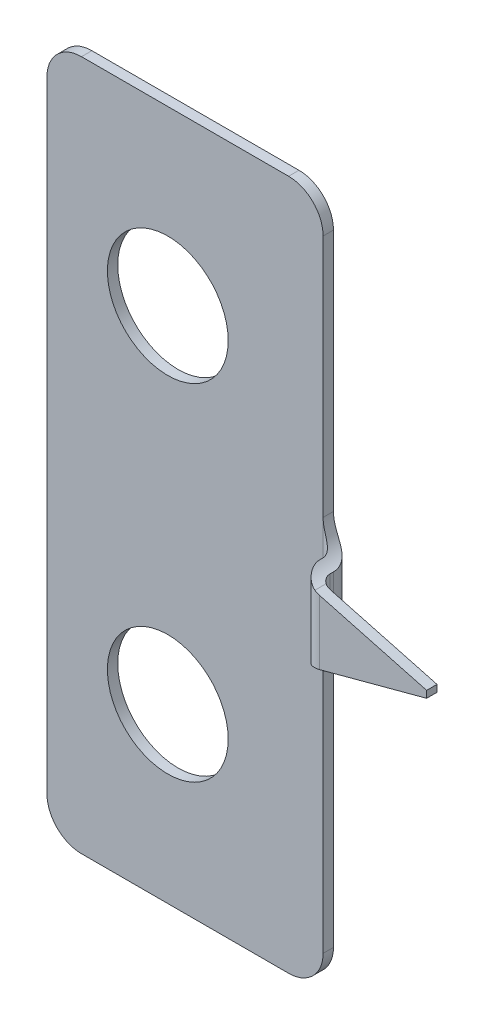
ISO-10303-21;
HEADER;
FILE_DESCRIPTION(('STEP AP214'),'2;1');
FILE_NAME('part.step','',(''),(''),'','','');
FILE_SCHEMA(('AUTOMOTIVE_DESIGN { 1 0 10303 214 1 1 1 1 }'));
ENDSEC;
DATA;
#1=APPLICATION_CONTEXT('core data for automotive mechanical design processes');
#2=APPLICATION_PROTOCOL_DEFINITION('international standard','automotive_design',2000,#1);
#3=PRODUCT_CONTEXT('',#1,'mechanical');
#4=PRODUCT('Part','Part','',(#3));
#5=PRODUCT_RELATED_PRODUCT_CATEGORY('part','',(#4));
#6=PRODUCT_DEFINITION_FORMATION('','',#4);
#7=PRODUCT_DEFINITION_CONTEXT('part definition',#1,'design');
#8=PRODUCT_DEFINITION('design','',#6,#7);
#9=PRODUCT_DEFINITION_SHAPE('','',#8);
#10=(LENGTH_UNIT() NAMED_UNIT(*) SI_UNIT(.MILLI.,.METRE.));
#11=(NAMED_UNIT(*) PLANE_ANGLE_UNIT() SI_UNIT($,.RADIAN.));
#12=(NAMED_UNIT(*) SI_UNIT($,.STERADIAN.) SOLID_ANGLE_UNIT());
#13=UNCERTAINTY_MEASURE_WITH_UNIT(LENGTH_MEASURE(1.E-05),#10,'distance_accuracy_value','');
#14=(GEOMETRIC_REPRESENTATION_CONTEXT(3) GLOBAL_UNCERTAINTY_ASSIGNED_CONTEXT((#13)) GLOBAL_UNIT_ASSIGNED_CONTEXT((#10,
#11,#12)) REPRESENTATION_CONTEXT('',''));
#15=CARTESIAN_POINT('',(0.,0.,0.));
#16=DIRECTION('',(0.,0.,1.));
#17=DIRECTION('',(1.,0.,0.));
#18=AXIS2_PLACEMENT_3D('',#15,#16,#17);
#19=CARTESIAN_POINT('',(-2.5,4.,0.));
#20=DIRECTION('',(0.,0.,-1.));
#21=DIRECTION('',(-1.,0.,0.));
#22=AXIS2_PLACEMENT_3D('',#19,#20,#21);
#23=PLANE('',#22);
#24=CARTESIAN_POINT('',(0.,-10.,0.));
#25=DIRECTION('',(0.,0.,-1.));
#26=DIRECTION('',(-1.,0.,0.));
#27=AXIS2_PLACEMENT_3D('',#24,#25,#26);
#28=CIRCLE('',#27,1.75);
#29=CARTESIAN_POINT('',(-1.75,-10.,0.));
#30=VERTEX_POINT('',#29);
#31=EDGE_CURVE('E436',#30,#30,#28,.T.);
#32=ORIENTED_EDGE('',*,*,#31,.F.);
#33=EDGE_LOOP('',(#32));
#34=FACE_BOUND('',#33,.T.);
#35=CARTESIAN_POINT('',(0.,0.,0.));
#36=DIRECTION('',(0.,0.,-1.));
#37=DIRECTION('',(-1.,0.,0.));
#38=AXIS2_PLACEMENT_3D('',#35,#36,#37);
#39=CIRCLE('',#38,1.75);
#40=CARTESIAN_POINT('',(-1.75,0.,0.));
#41=VERTEX_POINT('',#40);
#42=EDGE_CURVE('E424',#41,#41,#39,.T.);
#43=ORIENTED_EDGE('',*,*,#42,.F.);
#44=EDGE_LOOP('',(#43));
#45=FACE_BOUND('',#44,.T.);
#46=DIRECTION('',(0.,1.,0.));
#47=VECTOR('',#46,1.);
#48=CARTESIAN_POINT('',(4.5,4.,0.));
#49=LINE('',#48,#47);
#50=CARTESIAN_POINT('',(4.5,-3.06087624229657,0.));
#51=VERTEX_POINT('',#50);
#52=CARTESIAN_POINT('',(4.5,4.,0.));
#53=VERTEX_POINT('',#52);
#54=EDGE_CURVE('E122',#51,#53,#49,.T.);
#55=ORIENTED_EDGE('',*,*,#54,.F.);
#56=DIRECTION('',(0.,1.,0.));
#57=VECTOR('',#56,1.);
#58=CARTESIAN_POINT('',(4.5,-15.,0.));
#59=LINE('',#58,#57);
#60=CARTESIAN_POINT('',(4.5,-6.93912375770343,0.));
#61=VERTEX_POINT('',#60);
#62=EDGE_CURVE('E162',#51,#61,#59,.F.);
#63=ORIENTED_EDGE('',*,*,#62,.T.);
#64=DIRECTION('',(0.,1.,0.));
#65=VECTOR('',#64,1.);
#66=CARTESIAN_POINT('',(4.5,-14.,0.));
#67=LINE('',#66,#65);
#68=CARTESIAN_POINT('',(4.5,-14.,0.));
#69=VERTEX_POINT('',#68);
#70=EDGE_CURVE('E119',#69,#61,#67,.T.);
#71=ORIENTED_EDGE('',*,*,#70,.F.);
#72=CARTESIAN_POINT('',(3.5,-14.,0.));
#73=DIRECTION('',(0.,0.,1.));
#74=DIRECTION('',(1.,0.,0.));
#75=AXIS2_PLACEMENT_3D('',#72,#73,#74);
#76=CIRCLE('',#75,1.);
#77=CARTESIAN_POINT('',(3.5,-15.,0.));
#78=VERTEX_POINT('',#77);
#79=EDGE_CURVE('E116',#78,#69,#76,.T.);
#80=ORIENTED_EDGE('',*,*,#79,.F.);
#81=DIRECTION('',(1.,0.,0.));
#82=VECTOR('',#81,1.);
#83=CARTESIAN_POINT('',(-2.5,-15.,0.));
#84=LINE('',#83,#82);
#85=CARTESIAN_POINT('',(-2.5,-15.,0.));
#86=VERTEX_POINT('',#85);
#87=EDGE_CURVE('E113',#86,#78,#84,.T.);
#88=ORIENTED_EDGE('',*,*,#87,.F.);
#89=CARTESIAN_POINT('',(-2.5,-14.,0.));
#90=DIRECTION('',(0.,0.,1.));
#91=DIRECTION('',(1.,0.,0.));
#92=AXIS2_PLACEMENT_3D('',#89,#90,#91);
#93=CIRCLE('',#92,1.);
#94=CARTESIAN_POINT('',(-3.5,-14.,0.));
#95=VERTEX_POINT('',#94);
#96=EDGE_CURVE('E103',#95,#86,#93,.T.);
#97=ORIENTED_EDGE('',*,*,#96,.F.);
#98=DIRECTION('',(0.,-1.,0.));
#99=VECTOR('',#98,1.);
#100=CARTESIAN_POINT('',(-3.5,4.,0.));
#101=LINE('',#100,#99);
#102=CARTESIAN_POINT('',(-3.5,4.,0.));
#103=VERTEX_POINT('',#102);
#104=EDGE_CURVE('E100',#103,#95,#101,.T.);
#105=ORIENTED_EDGE('',*,*,#104,.F.);
#106=CARTESIAN_POINT('',(-2.5,4.,0.));
#107=DIRECTION('',(0.,0.,1.));
#108=DIRECTION('',(-1.,0.,0.));
#109=AXIS2_PLACEMENT_3D('',#106,#107,#108);
#110=CIRCLE('',#109,1.);
#111=CARTESIAN_POINT('',(-2.5,5.,0.));
#112=VERTEX_POINT('',#111);
#113=EDGE_CURVE('E77',#112,#103,#110,.T.);
#114=ORIENTED_EDGE('',*,*,#113,.F.);
#115=DIRECTION('',(-1.,0.,0.));
#116=VECTOR('',#115,1.);
#117=CARTESIAN_POINT('',(-2.5,5.,0.));
#118=LINE('',#117,#116);
#119=CARTESIAN_POINT('',(3.5,5.,0.));
#120=VERTEX_POINT('',#119);
#121=EDGE_CURVE('E87',#120,#112,#118,.T.);
#122=ORIENTED_EDGE('',*,*,#121,.F.);
#123=CARTESIAN_POINT('',(3.5,4.,0.));
#124=DIRECTION('',(0.,0.,1.));
#125=DIRECTION('',(-1.,0.,0.));
#126=AXIS2_PLACEMENT_3D('',#123,#124,#125);
#127=CIRCLE('',#126,1.);
#128=EDGE_CURVE('E94',#53,#120,#127,.T.);
#129=ORIENTED_EDGE('',*,*,#128,.F.);
#130=EDGE_LOOP('',(#55,#63,#71,#80,#88,#97,#105,#114,#122,#129));
#131=FACE_BOUND('',#130,.T.);
#132=ADVANCED_FACE('F14',(#34,#45,#131),#23,.T.);
#133=CARTESIAN_POINT('',(-2.5,4.,1.3));
#134=DIRECTION('',(0.,0.,-1.));
#135=DIRECTION('',(-1.,0.,0.));
#136=AXIS2_PLACEMENT_3D('',#133,#134,#135);
#137=CYLINDRICAL_SURFACE('',#136,1.);
#138=DIRECTION('',(0.,0.,-1.));
#139=VECTOR('',#138,1.);
#140=CARTESIAN_POINT('',(-3.5,4.,1.3));
#141=LINE('',#140,#139);
#142=CARTESIAN_POINT('',(-3.5,4.,0.3));
#143=VERTEX_POINT('',#142);
#144=EDGE_CURVE('E155',#143,#103,#141,.T.);
#145=ORIENTED_EDGE('',*,*,#144,.F.);
#146=CARTESIAN_POINT('',(-2.5,4.,0.3));
#147=DIRECTION('',(0.,0.,-1.));
#148=DIRECTION('',(-1.,0.,0.));
#149=AXIS2_PLACEMENT_3D('',#146,#147,#148);
#150=CIRCLE('',#149,1.);
#151=CARTESIAN_POINT('',(-2.5,5.,0.3));
#152=VERTEX_POINT('',#151);
#153=EDGE_CURVE('E80',#143,#152,#150,.T.);
#154=ORIENTED_EDGE('',*,*,#153,.T.);
#155=DIRECTION('',(0.,0.,-1.));
#156=VECTOR('',#155,1.);
#157=CARTESIAN_POINT('',(-2.5,5.,1.3));
#158=LINE('',#157,#156);
#159=EDGE_CURVE('E73',#152,#112,#158,.T.);
#160=ORIENTED_EDGE('',*,*,#159,.T.);
#161=ORIENTED_EDGE('',*,*,#113,.T.);
#162=EDGE_LOOP('',(#145,#154,#160,#161));
#163=FACE_BOUND('',#162,.T.);
#164=ADVANCED_FACE('F16',(#163),#137,.T.);
#165=CARTESIAN_POINT('',(-3.5,4.,1.3));
#166=DIRECTION('',(1.,0.,0.));
#167=DIRECTION('',(0.,1.,0.));
#168=AXIS2_PLACEMENT_3D('',#165,#166,#167);
#169=PLANE('',#168);
#170=DIRECTION('',(0.,0.,-1.));
#171=VECTOR('',#170,1.);
#172=CARTESIAN_POINT('',(-3.5,-14.,1.3));
#173=LINE('',#172,#171);
#174=CARTESIAN_POINT('',(-3.5,-14.,0.3));
#175=VERTEX_POINT('',#174);
#176=EDGE_CURVE('E153',#175,#95,#173,.T.);
#177=ORIENTED_EDGE('',*,*,#176,.F.);
#178=DIRECTION('',(0.,1.,0.));
#179=VECTOR('',#178,1.);
#180=CARTESIAN_POINT('',(-3.5,-15.,0.3));
#181=LINE('',#180,#179);
#182=EDGE_CURVE('E452',#175,#143,#181,.T.);
#183=ORIENTED_EDGE('',*,*,#182,.T.);
#184=ORIENTED_EDGE('',*,*,#144,.T.);
#185=ORIENTED_EDGE('',*,*,#104,.T.);
#186=EDGE_LOOP('',(#177,#183,#184,#185));
#187=FACE_BOUND('',#186,.T.);
#188=ADVANCED_FACE('F460',(#187),#169,.F.);
#189=CARTESIAN_POINT('',(-2.5,-14.,1.3));
#190=DIRECTION('',(0.,0.,-1.));
#191=DIRECTION('',(-1.,0.,0.));
#192=AXIS2_PLACEMENT_3D('',#189,#190,#191);
#193=CYLINDRICAL_SURFACE('',#192,1.);
#194=DIRECTION('',(0.,0.,-1.));
#195=VECTOR('',#194,1.);
#196=CARTESIAN_POINT('',(-2.5,-15.,1.3));
#197=LINE('',#196,#195);
#198=CARTESIAN_POINT('',(-2.5,-15.,0.3));
#199=VERTEX_POINT('',#198);
#200=EDGE_CURVE('E151',#199,#86,#197,.T.);
#201=ORIENTED_EDGE('',*,*,#200,.F.);
#202=CARTESIAN_POINT('',(-2.5,-14.,0.3));
#203=DIRECTION('',(0.,0.,-1.));
#204=DIRECTION('',(-1.,0.,0.));
#205=AXIS2_PLACEMENT_3D('',#202,#203,#204);
#206=CIRCLE('',#205,1.);
#207=EDGE_CURVE('E294',#199,#175,#206,.T.);
#208=ORIENTED_EDGE('',*,*,#207,.T.);
#209=ORIENTED_EDGE('',*,*,#176,.T.);
#210=ORIENTED_EDGE('',*,*,#96,.T.);
#211=EDGE_LOOP('',(#201,#208,#209,#210));
#212=FACE_BOUND('',#211,.T.);
#213=ADVANCED_FACE('F459',(#212),#193,.T.);
#214=CARTESIAN_POINT('',(-2.5,-15.,1.3));
#215=DIRECTION('',(0.,1.,0.));
#216=DIRECTION('',(0.,0.,1.));
#217=AXIS2_PLACEMENT_3D('',#214,#215,#216);
#218=PLANE('',#217);
#219=DIRECTION('',(0.,0.,-1.));
#220=VECTOR('',#219,1.);
#221=CARTESIAN_POINT('',(3.5,-15.,1.3));
#222=LINE('',#221,#220);
#223=CARTESIAN_POINT('',(3.5,-15.,0.3));
#224=VERTEX_POINT('',#223);
#225=EDGE_CURVE('E149',#224,#78,#222,.T.);
#226=ORIENTED_EDGE('',*,*,#225,.F.);
#227=DIRECTION('',(-1.,0.,0.));
#228=VECTOR('',#227,1.);
#229=CARTESIAN_POINT('',(-3.5,-15.,0.3));
#230=LINE('',#229,#228);
#231=EDGE_CURVE('E466',#224,#199,#230,.T.);
#232=ORIENTED_EDGE('',*,*,#231,.T.);
#233=ORIENTED_EDGE('',*,*,#200,.T.);
#234=ORIENTED_EDGE('',*,*,#87,.T.);
#235=EDGE_LOOP('',(#226,#232,#233,#234));
#236=FACE_BOUND('',#235,.T.);
#237=ADVANCED_FACE('F465',(#236),#218,.F.);
#238=CARTESIAN_POINT('',(3.5,-14.,1.3));
#239=DIRECTION('',(0.,0.,-1.));
#240=DIRECTION('',(-1.,0.,0.));
#241=AXIS2_PLACEMENT_3D('',#238,#239,#240);
#242=CYLINDRICAL_SURFACE('',#241,1.);
#243=DIRECTION('',(0.,0.,-1.));
#244=VECTOR('',#243,1.);
#245=CARTESIAN_POINT('',(4.5,-14.,1.3));
#246=LINE('',#245,#244);
#247=CARTESIAN_POINT('',(4.5,-14.,0.3));
#248=VERTEX_POINT('',#247);
#249=EDGE_CURVE('E147',#248,#69,#246,.T.);
#250=ORIENTED_EDGE('',*,*,#249,.F.);
#251=CARTESIAN_POINT('',(3.5,-14.,0.3));
#252=DIRECTION('',(0.,0.,-1.));
#253=DIRECTION('',(-1.,0.,0.));
#254=AXIS2_PLACEMENT_3D('',#251,#252,#253);
#255=CIRCLE('',#254,1.);
#256=EDGE_CURVE('E288',#248,#224,#255,.T.);
#257=ORIENTED_EDGE('',*,*,#256,.T.);
#258=ORIENTED_EDGE('',*,*,#225,.T.);
#259=ORIENTED_EDGE('',*,*,#79,.T.);
#260=EDGE_LOOP('',(#250,#257,#258,#259));
#261=FACE_BOUND('',#260,.T.);
#262=ADVANCED_FACE('F491',(#261),#242,.T.);
#263=CARTESIAN_POINT('',(4.5,-14.,1.3));
#264=DIRECTION('',(-1.,0.,0.));
#265=DIRECTION('',(0.,-1.,0.));
#266=AXIS2_PLACEMENT_3D('',#263,#264,#265);
#267=PLANE('',#266);
#268=DIRECTION('',(0.,0.,-1.));
#269=VECTOR('',#268,1.);
#270=CARTESIAN_POINT('',(4.5,-6.93912375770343,1.3));
#271=LINE('',#270,#269);
#272=CARTESIAN_POINT('',(4.5,-6.93912375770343,0.3));
#273=VERTEX_POINT('',#272);
#274=EDGE_CURVE('E144',#273,#61,#271,.T.);
#275=ORIENTED_EDGE('',*,*,#274,.F.);
#276=DIRECTION('',(0.,1.,0.));
#277=VECTOR('',#276,1.);
#278=CARTESIAN_POINT('',(4.5,-15.,0.3));
#279=LINE('',#278,#277);
#280=EDGE_CURVE('E456',#248,#273,#279,.T.);
#281=ORIENTED_EDGE('',*,*,#280,.F.);
#282=ORIENTED_EDGE('',*,*,#249,.T.);
#283=ORIENTED_EDGE('',*,*,#70,.T.);
#284=EDGE_LOOP('',(#275,#281,#282,#283));
#285=FACE_BOUND('',#284,.T.);
#286=ADVANCED_FACE('F209',(#285),#267,.F.);
#287=CARTESIAN_POINT('',(5.5,-6.93912375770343,1.3));
#288=DIRECTION('',(0.,0.,-1.));
#289=DIRECTION('',(-1.,0.,0.));
#290=AXIS2_PLACEMENT_3D('',#287,#288,#289);
#291=CYLINDRICAL_SURFACE('',#290,1.);
#292=DIRECTION('',(0.,0.,-1.));
#293=VECTOR('',#292,1.);
#294=CARTESIAN_POINT('',(5.1,-6.02260861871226,1.3));
#295=LINE('',#294,#293);
#296=CARTESIAN_POINT('',(5.1,-6.02260861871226,0.6));
#297=VERTEX_POINT('',#296);
#298=CARTESIAN_POINT('',(5.1,-6.02260861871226,0.7));
#299=VERTEX_POINT('',#298);
#300=EDGE_CURVE('E241',#297,#299,#295,.F.);
#301=ORIENTED_EDGE('',*,*,#300,.T.);
#302=CARTESIAN_POINT('',(5.24118095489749,-5.97319793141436,0.445487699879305));
#303=CARTESIAN_POINT('',(5.22663222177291,-5.97709046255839,0.454559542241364));
#304=CARTESIAN_POINT('',(5.21289703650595,-5.9811291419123,0.464869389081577));
#305=CARTESIAN_POINT('',(5.18734197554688,-5.98916482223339,0.487703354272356));
#306=CARTESIAN_POINT('',(5.1755261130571,-5.99316171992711,0.500232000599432));
#307=CARTESIAN_POINT('',(5.15414992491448,-6.0007647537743,0.527215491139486));
#308=CARTESIAN_POINT('',(5.14459186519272,-6.00437049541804,0.541672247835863));
#309=CARTESIAN_POINT('',(5.12806118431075,-6.01082403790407,0.572136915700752));
#310=CARTESIAN_POINT('',(5.12108573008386,-6.01367266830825,0.588143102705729));
#311=CARTESIAN_POINT('',(5.11019882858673,-6.01820635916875,0.620641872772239));
#312=CARTESIAN_POINT('',(5.10618163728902,-6.01993129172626,0.637093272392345));
#313=CARTESIAN_POINT('',(5.10097397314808,-6.02217957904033,0.670518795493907));
#314=CARTESIAN_POINT('',(5.09978257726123,-6.02270332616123,0.687492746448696));
#315=CARTESIAN_POINT('',(5.10026480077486,-6.02249322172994,0.720145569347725));
#316=CARTESIAN_POINT('',(5.10173550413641,-6.02184843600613,0.735828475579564));
#317=CARTESIAN_POINT('',(5.10708871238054,-6.01954282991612,0.766695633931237));
#318=CARTESIAN_POINT('',(5.11097093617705,-6.01788212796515,0.781879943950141));
#319=CARTESIAN_POINT('',(5.12099064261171,-6.01371518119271,0.811335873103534));
#320=CARTESIAN_POINT('',(5.1271254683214,-6.01120993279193,0.825608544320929));
#321=CARTESIAN_POINT('',(5.14145826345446,-6.00557841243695,0.852953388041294));
#322=CARTESIAN_POINT('',(5.14965794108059,-6.00245162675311,0.866024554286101));
#323=CARTESIAN_POINT('',(5.16855538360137,-5.99559180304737,0.891582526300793));
#324=CARTESIAN_POINT('',(5.17938984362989,-5.99183140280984,0.903960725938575));
#325=CARTESIAN_POINT('',(5.20289322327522,-5.98420009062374,0.926750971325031));
#326=CARTESIAN_POINT('',(5.21555856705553,-5.98032940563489,0.937166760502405));
#327=CARTESIAN_POINT('',(5.23298633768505,-5.97542189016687,0.949259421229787));
#328=CARTESIAN_POINT('',(5.23705188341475,-5.97430402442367,0.95193616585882));
#329=CARTESIAN_POINT('',(5.24118095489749,-5.97319793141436,0.954512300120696));
#330=B_SPLINE_CURVE_WITH_KNOTS('',3,(#302,#303,#304,#305,#306,#307,#308,#309,#310,#311,#312,
#313,#314,#315,#316,#317,#318,#319,#320,#321,#322,#323,#324,#325,#326,#327,#328,#329),
.UNSPECIFIED.,.F.,.F.,(4,2,2,2,2,2,2,2,2,2,2,2,2,4),(0.,0.0526827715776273,0.105474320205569,
0.158318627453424,0.21110479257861,0.261897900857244,0.312674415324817,0.359742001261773,
0.406804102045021,0.453810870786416,0.500856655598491,0.551266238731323,0.601578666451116,
0.616555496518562),.UNSPECIFIED.);
#331=CARTESIAN_POINT('',(5.24118095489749,-5.97319793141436,0.954512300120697));
#332=VERTEX_POINT('',#331);
#333=EDGE_CURVE('E190',#299,#332,#330,.T.);
#334=ORIENTED_EDGE('',*,*,#333,.T.);
#335=DIRECTION('',(0.,0.,-1.));
#336=VECTOR('',#335,1.);
#337=CARTESIAN_POINT('',(5.24118095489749,-5.97319793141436,1.3));
#338=LINE('',#337,#336);
#339=CARTESIAN_POINT('',(5.24118095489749,-5.97319793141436,1.27859874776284));
#340=VERTEX_POINT('',#339);
#341=EDGE_CURVE('E141',#340,#332,#338,.T.);
#342=ORIENTED_EDGE('',*,*,#341,.F.);
#343=CARTESIAN_POINT('',(5.24118095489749,-5.97319793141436,1.27859874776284));
#344=CARTESIAN_POINT('',(5.20731503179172,-5.98223793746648,1.26930379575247));
#345=CARTESIAN_POINT('',(5.17479210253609,-5.99289238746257,1.25718302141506));
#346=CARTESIAN_POINT('',(5.11315650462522,-6.01640271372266,1.22808351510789));
#347=CARTESIAN_POINT('',(5.08402145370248,-6.02924257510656,1.21113955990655));
#348=CARTESIAN_POINT('',(5.02950696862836,-6.05619482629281,1.17311486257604));
#349=CARTESIAN_POINT('',(5.0041126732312,-6.07030180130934,1.15205130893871));
#350=CARTESIAN_POINT('',(4.95707513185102,-6.09889064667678,1.10608278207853));
#351=CARTESIAN_POINT('',(4.93544879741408,-6.11337388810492,1.08116139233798));
#352=CARTESIAN_POINT('',(4.89417325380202,-6.14307756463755,1.02479956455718));
#353=CARTESIAN_POINT('',(4.87501703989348,-6.15819878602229,0.99294156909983));
#354=CARTESIAN_POINT('',(4.8426527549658,-6.18524279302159,0.925287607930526));
#355=CARTESIAN_POINT('',(4.82940319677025,-6.19718764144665,0.889521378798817));
#356=CARTESIAN_POINT('',(4.81325736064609,-6.21216736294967,0.827896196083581));
#357=CARTESIAN_POINT('',(4.8083590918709,-6.21685819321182,0.80297128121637));
#358=CARTESIAN_POINT('',(4.80169858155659,-6.22331420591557,0.752069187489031));
#359=CARTESIAN_POINT('',(4.79997096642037,-6.22504707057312,0.72608352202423));
#360=CARTESIAN_POINT('',(4.8,-6.22498091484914,0.7));
#361=B_SPLINE_CURVE_WITH_KNOTS('',3,(#343,#344,#345,#346,#347,#348,#349,#350,#351,#352,#353,
#354,#355,#356,#357,#358,#359,#360),.UNSPECIFIED.,.F.,.F.,(4,2,2,2,2,2,2,2,4),(0.,
0.108439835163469,0.216116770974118,0.323353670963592,0.431060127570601,0.55083407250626,
0.669752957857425,0.746891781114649,0.824868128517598),.UNSPECIFIED.);
#362=CARTESIAN_POINT('',(4.8,-6.22498091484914,0.7));
#363=VERTEX_POINT('',#362);
#364=EDGE_CURVE('E216',#340,#363,#361,.T.);
#365=ORIENTED_EDGE('',*,*,#364,.T.);
#366=DIRECTION('',(0.,0.,-1.));
#367=VECTOR('',#366,1.);
#368=CARTESIAN_POINT('',(4.8,-6.22498091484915,1.3));
#369=LINE('',#368,#367);
#370=CARTESIAN_POINT('',(4.8,-6.22498091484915,0.6));
#371=VERTEX_POINT('',#370);
#372=EDGE_CURVE('E101',#363,#371,#369,.T.);
#373=ORIENTED_EDGE('',*,*,#372,.T.);
#374=CARTESIAN_POINT('',(4.8,-6.22498091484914,0.6));
#375=CARTESIAN_POINT('',(4.80002205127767,-6.22497011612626,0.58697520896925));
#376=CARTESIAN_POINT('',(4.79915314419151,-6.22581090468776,0.5739691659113));
#377=CARTESIAN_POINT('',(4.79580999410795,-6.22910552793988,0.548449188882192));
#378=CARTESIAN_POINT('',(4.79334506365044,-6.23155000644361,0.535932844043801));
#379=CARTESIAN_POINT('',(4.78698649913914,-6.23795994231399,0.511701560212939));
#380=CARTESIAN_POINT('',(4.78309452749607,-6.24192363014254,0.499985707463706));
#381=CARTESIAN_POINT('',(4.77415404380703,-6.25123604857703,0.477586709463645));
#382=CARTESIAN_POINT('',(4.76910434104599,-6.25658620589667,0.466904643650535));
#383=CARTESIAN_POINT('',(4.75789456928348,-6.26878737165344,0.446263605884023));
#384=CARTESIAN_POINT('',(4.75169359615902,-6.27569690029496,0.436361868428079));
#385=CARTESIAN_POINT('',(4.73869195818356,-6.29065724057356,0.417918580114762));
#386=CARTESIAN_POINT('',(4.73189104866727,-6.29870851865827,0.409377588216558));
#387=CARTESIAN_POINT('',(4.71378539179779,-6.32092065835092,0.388860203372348));
#388=CARTESIAN_POINT('',(4.70223688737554,-6.3358388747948,0.377916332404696));
#389=CARTESIAN_POINT('',(4.6792439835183,-6.36750615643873,0.358972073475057));
#390=CARTESIAN_POINT('',(4.66779991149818,-6.38425965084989,0.350979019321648));
#391=CARTESIAN_POINT('',(4.63926502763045,-6.42904430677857,0.333494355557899));
#392=CARTESIAN_POINT('',(4.62267147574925,-6.45806293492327,0.325743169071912));
#393=CARTESIAN_POINT('',(4.59224672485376,-6.51825163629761,0.314069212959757));
#394=CARTESIAN_POINT('',(4.57842434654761,-6.54942816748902,0.310158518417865));
#395=CARTESIAN_POINT('',(4.55674004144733,-6.60601467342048,0.305256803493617));
#396=CARTESIAN_POINT('',(4.54823669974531,-6.6311461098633,0.303807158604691));
#397=CARTESIAN_POINT('',(4.5332435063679,-6.68205114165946,0.301751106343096));
#398=CARTESIAN_POINT('',(4.5267549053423,-6.70782512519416,0.301145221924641));
#399=CARTESIAN_POINT('',(4.51585976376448,-6.75976113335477,0.30037003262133));
#400=CARTESIAN_POINT('',(4.51144929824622,-6.78592232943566,0.300199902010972));
#401=CARTESIAN_POINT('',(4.50472146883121,-6.83851113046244,0.300018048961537));
#402=CARTESIAN_POINT('',(4.502403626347,-6.86493867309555,0.300006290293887));
#403=CARTESIAN_POINT('',(4.5007591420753,-6.8993598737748,0.300000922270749));
#404=CARTESIAN_POINT('',(4.50047430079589,-6.90731522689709,0.300000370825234));
#405=CARTESIAN_POINT('',(4.50009486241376,-6.92322139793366,0.299999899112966));
#406=CARTESIAN_POINT('',(4.50000004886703,-6.93117221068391,0.299999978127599));
#407=CARTESIAN_POINT('',(4.5,-6.93912375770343,0.3));
#408=B_SPLINE_CURVE_WITH_KNOTS('',3,(#374,#375,#376,#377,#378,#379,#380,#381,#382,#383,#384,
#385,#386,#387,#388,#389,#390,#391,#392,#393,#394,#395,#396,#397,#398,#399,#400,#401,#402,#403,
#404,#405,#406,#407),.UNSPECIFIED.,.F.,.F.,(4,2,2,2,2,2,2,2,2,2,2,2,2,2,2,2,4),(0.,
0.0389888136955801,0.077752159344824,0.116470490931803,0.155228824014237,0.195800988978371,
0.236389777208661,0.301444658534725,0.366660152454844,0.469028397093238,0.571717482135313,
0.651330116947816,0.730992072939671,0.810502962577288,0.889995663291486,0.913875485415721,
0.937728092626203),.UNSPECIFIED.);
#409=EDGE_CURVE('E106',#371,#273,#408,.T.);
#410=ORIENTED_EDGE('',*,*,#409,.T.);
#411=ORIENTED_EDGE('',*,*,#274,.T.);
#412=CARTESIAN_POINT('',(4.5,-6.93912375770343,0.));
#413=CARTESIAN_POINT('',(4.49999829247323,-6.91381879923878,9.56660425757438E-06));
#414=CARTESIAN_POINT('',(4.50096052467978,-6.88851496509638,2.00959740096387E-07));
#415=CARTESIAN_POINT('',(4.50479939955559,-6.83805354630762,1.36224945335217E-05));
#416=CARTESIAN_POINT('',(4.50767599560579,-6.81289595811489,3.6408890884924E-05));
#417=CARTESIAN_POINT('',(4.51535669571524,-6.76269615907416,0.000184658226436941));
#418=CARTESIAN_POINT('',(4.52017404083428,-6.73765596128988,0.000310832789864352));
#419=CARTESIAN_POINT('',(4.53170314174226,-6.688023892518,0.000811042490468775));
#420=CARTESIAN_POINT('',(4.53841499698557,-6.66343204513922,0.0011850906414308));
#421=CARTESIAN_POINT('',(4.56295236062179,-6.58542043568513,0.00306417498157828));
#422=CARTESIAN_POINT('',(4.58440235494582,-6.53310112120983,0.0053898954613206));
#423=CARTESIAN_POINT('',(4.63555333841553,-6.43331172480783,0.014940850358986));
#424=CARTESIAN_POINT('',(4.66521858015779,-6.38582182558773,0.0221450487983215));
#425=CARTESIAN_POINT('',(4.71904274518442,-6.31354147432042,0.0409718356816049));
#426=CARTESIAN_POINT('',(4.74135587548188,-6.28672194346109,0.0500801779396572));
#427=CARTESIAN_POINT('',(4.78757424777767,-6.23655198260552,0.0727787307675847));
#428=CARTESIAN_POINT('',(4.81147815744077,-6.21319870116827,0.0863652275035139));
#429=CARTESIAN_POINT('',(4.85965002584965,-6.17035828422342,0.118854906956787));
#430=CARTESIAN_POINT('',(4.88391935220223,-6.15090567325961,0.13780227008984));
#431=CARTESIAN_POINT('',(4.93074554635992,-6.11644746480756,0.181106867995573));
#432=CARTESIAN_POINT('',(4.9533033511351,-6.10143942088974,0.205461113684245));
#433=CARTESIAN_POINT('',(4.99209813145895,-6.07744606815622,0.255461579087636));
#434=CARTESIAN_POINT('',(5.00877638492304,-6.06792739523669,0.280513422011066));
#435=CARTESIAN_POINT('',(5.03846610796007,-6.05183977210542,0.3335828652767));
#436=CARTESIAN_POINT('',(5.05147612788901,-6.04527198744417,0.361601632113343));
#437=CARTESIAN_POINT('',(5.07269993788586,-6.03493975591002,0.418601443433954));
#438=CARTESIAN_POINT('',(5.08107969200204,-6.03107675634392,0.447503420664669));
#439=CARTESIAN_POINT('',(5.09341227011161,-6.02548569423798,0.506389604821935));
#440=CARTESIAN_POINT('',(5.09737391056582,-6.02375337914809,0.53637153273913));
#441=CARTESIAN_POINT('',(5.0996890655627,-6.02274560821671,0.577641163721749));
#442=CARTESIAN_POINT('',(5.10000276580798,-6.02261013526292,0.588823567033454));
#443=CARTESIAN_POINT('',(5.1,-6.02260861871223,0.6));
#444=B_SPLINE_CURVE_WITH_KNOTS('',3,(#412,#413,#414,#415,#416,#417,#418,#419,#420,#421,#422,
#423,#424,#425,#426,#427,#428,#429,#430,#431,#432,#433,#434,#435,#436,#437,#438,#439,#440,#441,
#442,#443),.UNSPECIFIED.,.F.,.F.,(4,2,2,2,2,2,2,2,2,2,2,2,2,2,2,4),(0.,0.075894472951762,
0.151787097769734,0.228206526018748,0.304629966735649,0.473469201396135,0.641584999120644,
0.749354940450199,0.857035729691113,0.96563117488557,1.07416673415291,1.1683828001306,
1.2626360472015,1.35324579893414,1.44367441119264,1.47721445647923),.UNSPECIFIED.);
#445=EDGE_CURVE('E233',#61,#297,#444,.T.);
#446=ORIENTED_EDGE('',*,*,#445,.T.);
#447=EDGE_LOOP('',(#301,#334,#342,#365,#373,#410,#411,#446));
#448=FACE_BOUND('',#447,.T.);
#449=ADVANCED_FACE('F203',(#448),#291,.F.);
#450=CARTESIAN_POINT('',(8.5,-5.1,1.3));
#451=DIRECTION('',(-0.258819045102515,0.96592582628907,0.));
#452=DIRECTION('',(-0.96592582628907,-0.258819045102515,0.));
#453=AXIS2_PLACEMENT_3D('',#450,#451,#452);
#454=PLANE('',#453);
#455=CARTESIAN_POINT('',(5.4,-5.93064249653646,0.7));
#456=DIRECTION('',(-0.258819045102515,0.96592582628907,0.));
#457=DIRECTION('',(0.96592582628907,0.258819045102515,0.));
#458=AXIS2_PLACEMENT_3D('',#455,#456,#457);
#459=ELLIPSE('',#458,0.310582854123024,0.3);
#460=CARTESIAN_POINT('',(5.4,-5.93064249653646,1.));
#461=VERTEX_POINT('',#460);
#462=EDGE_CURVE('E200',#332,#461,#459,.T.);
#463=ORIENTED_EDGE('',*,*,#462,.T.);
#464=DIRECTION('',(0.96592582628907,0.258819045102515,0.));
#465=VECTOR('',#464,1.);
#466=CARTESIAN_POINT('',(8.5,-5.1,1.));
#467=LINE('',#466,#465);
#468=CARTESIAN_POINT('',(8.5,-5.1,1.));
#469=VERTEX_POINT('',#468);
#470=EDGE_CURVE('E199',#461,#469,#467,.T.);
#471=ORIENTED_EDGE('',*,*,#470,.T.);
#472=DIRECTION('',(0.,0.,-1.));
#473=VECTOR('',#472,1.);
#474=CARTESIAN_POINT('',(8.5,-5.1,1.3));
#475=LINE('',#474,#473);
#476=CARTESIAN_POINT('',(8.5,-5.1,1.3));
#477=VERTEX_POINT('',#476);
#478=EDGE_CURVE('E138',#477,#469,#475,.T.);
#479=ORIENTED_EDGE('',*,*,#478,.F.);
#480=DIRECTION('',(0.96592582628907,0.258819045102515,0.));
#481=VECTOR('',#480,1.);
#482=CARTESIAN_POINT('',(8.5,-5.1,1.3));
#483=LINE('',#482,#481);
#484=CARTESIAN_POINT('',(5.4,-5.93064249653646,1.3));
#485=VERTEX_POINT('',#484);
#486=EDGE_CURVE('E93',#485,#477,#483,.T.);
#487=ORIENTED_EDGE('',*,*,#486,.F.);
#488=CARTESIAN_POINT('',(5.4,-5.93064249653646,0.7));
#489=DIRECTION('',(-0.258819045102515,0.96592582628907,0.));
#490=DIRECTION('',(0.96592582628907,0.258819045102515,0.));
#491=AXIS2_PLACEMENT_3D('',#488,#489,#490);
#492=ELLIPSE('',#491,0.621165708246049,0.6);
#493=EDGE_CURVE('E29',#485,#340,#492,.F.);
#494=ORIENTED_EDGE('',*,*,#493,.T.);
#495=ORIENTED_EDGE('',*,*,#341,.T.);
#496=EDGE_LOOP('',(#463,#471,#479,#487,#494,#495));
#497=FACE_BOUND('',#496,.T.);
#498=ADVANCED_FACE('F208',(#497),#454,.F.);
#499=CARTESIAN_POINT('',(8.5,-5.1,1.3));
#500=DIRECTION('',(-1.,0.,0.));
#501=DIRECTION('',(0.,0.,1.));
#502=AXIS2_PLACEMENT_3D('',#499,#500,#501);
#503=PLANE('',#502);
#504=ORIENTED_EDGE('',*,*,#478,.T.);
#505=DIRECTION('',(0.,1.,0.));
#506=VECTOR('',#505,1.);
#507=CARTESIAN_POINT('',(8.5,-15.,1.));
#508=LINE('',#507,#506);
#509=CARTESIAN_POINT('',(8.5,-4.9,1.));
#510=VERTEX_POINT('',#509);
#511=EDGE_CURVE('E415',#469,#510,#508,.T.);
#512=ORIENTED_EDGE('',*,*,#511,.T.);
#513=DIRECTION('',(0.,0.,-1.));
#514=VECTOR('',#513,1.);
#515=CARTESIAN_POINT('',(8.5,-4.9,1.3));
#516=LINE('',#515,#514);
#517=CARTESIAN_POINT('',(8.5,-4.9,1.3));
#518=VERTEX_POINT('',#517);
#519=EDGE_CURVE('E135',#518,#510,#516,.T.);
#520=ORIENTED_EDGE('',*,*,#519,.F.);
#521=DIRECTION('',(0.,1.,0.));
#522=VECTOR('',#521,1.);
#523=CARTESIAN_POINT('',(8.5,-5.1,1.3));
#524=LINE('',#523,#522);
#525=EDGE_CURVE('E38',#477,#518,#524,.T.);
#526=ORIENTED_EDGE('',*,*,#525,.F.);
#527=EDGE_LOOP('',(#504,#512,#520,#526));
#528=FACE_BOUND('',#527,.T.);
#529=ADVANCED_FACE('F476',(#528),#503,.F.);
#530=CARTESIAN_POINT('',(8.5,-4.9,1.3));
#531=DIRECTION('',(-0.258819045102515,-0.96592582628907,0.));
#532=DIRECTION('',(0.96592582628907,-0.258819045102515,0.));
#533=AXIS2_PLACEMENT_3D('',#530,#531,#532);
#534=PLANE('',#533);
#535=ORIENTED_EDGE('',*,*,#519,.T.);
#536=DIRECTION('',(-0.96592582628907,0.258819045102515,0.));
#537=VECTOR('',#536,1.);
#538=CARTESIAN_POINT('',(8.5,-4.9,1.));
#539=LINE('',#538,#537);
#540=CARTESIAN_POINT('',(5.4,-4.06935750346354,1.));
#541=VERTEX_POINT('',#540);
#542=EDGE_CURVE('E9',#510,#541,#539,.T.);
#543=ORIENTED_EDGE('',*,*,#542,.T.);
#544=CARTESIAN_POINT('',(5.4,-4.06935750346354,0.7));
#545=DIRECTION('',(-0.258819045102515,-0.96592582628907,0.));
#546=DIRECTION('',(-0.96592582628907,0.258819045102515,0.));
#547=AXIS2_PLACEMENT_3D('',#544,#545,#546);
#548=ELLIPSE('',#547,0.310582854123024,0.3);
#549=CARTESIAN_POINT('',(5.24118095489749,-4.02680206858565,0.954512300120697));
#550=VERTEX_POINT('',#549);
#551=EDGE_CURVE('E482',#541,#550,#548,.T.);
#552=ORIENTED_EDGE('',*,*,#551,.T.);
#553=DIRECTION('',(0.,0.,-1.));
#554=VECTOR('',#553,1.);
#555=CARTESIAN_POINT('',(5.24118095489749,-4.02680206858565,1.3));
#556=LINE('',#555,#554);
#557=CARTESIAN_POINT('',(5.24118095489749,-4.02680206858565,1.27859874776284));
#558=VERTEX_POINT('',#557);
#559=EDGE_CURVE('E132',#558,#550,#556,.T.);
#560=ORIENTED_EDGE('',*,*,#559,.F.);
#561=CARTESIAN_POINT('',(5.4,-4.06935750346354,0.7));
#562=DIRECTION('',(-0.258819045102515,-0.96592582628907,0.));
#563=DIRECTION('',(-0.96592582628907,0.258819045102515,0.));
#564=AXIS2_PLACEMENT_3D('',#561,#562,#563);
#565=ELLIPSE('',#564,0.621165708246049,0.6);
#566=CARTESIAN_POINT('',(5.4,-4.06935750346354,1.3));
#567=VERTEX_POINT('',#566);
#568=EDGE_CURVE('E275',#558,#567,#565,.F.);
#569=ORIENTED_EDGE('',*,*,#568,.T.);
#570=DIRECTION('',(-0.96592582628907,0.258819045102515,0.));
#571=VECTOR('',#570,1.);
#572=CARTESIAN_POINT('',(8.5,-4.9,1.3));
#573=LINE('',#572,#571);
#574=EDGE_CURVE('E84',#518,#567,#573,.T.);
#575=ORIENTED_EDGE('',*,*,#574,.F.);
#576=EDGE_LOOP('',(#535,#543,#552,#560,#569,#575));
#577=FACE_BOUND('',#576,.T.);
#578=ADVANCED_FACE('F326',(#577),#534,.F.);
#579=CARTESIAN_POINT('',(5.5,-3.06087624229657,1.3));
#580=DIRECTION('',(0.,0.,-1.));
#581=DIRECTION('',(-1.,0.,0.));
#582=AXIS2_PLACEMENT_3D('',#579,#580,#581);
#583=CYLINDRICAL_SURFACE('',#582,1.);
#584=ORIENTED_EDGE('',*,*,#559,.T.);
#585=CARTESIAN_POINT('',(5.24118095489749,-4.02680206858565,0.954512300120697));
#586=CARTESIAN_POINT('',(5.22663222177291,-4.02290953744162,0.945440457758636));
#587=CARTESIAN_POINT('',(5.21289703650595,-4.0188708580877,0.935130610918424));
#588=CARTESIAN_POINT('',(5.18734197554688,-4.01083517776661,0.912296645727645));
#589=CARTESIAN_POINT('',(5.1755261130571,-4.00683828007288,0.89976799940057));
#590=CARTESIAN_POINT('',(5.15414992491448,-3.9992352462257,0.872784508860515));
#591=CARTESIAN_POINT('',(5.14459186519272,-3.99562950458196,0.858327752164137));
#592=CARTESIAN_POINT('',(5.12806118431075,-3.98917596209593,0.827863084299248));
#593=CARTESIAN_POINT('',(5.12108573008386,-3.98632733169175,0.811856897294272));
#594=CARTESIAN_POINT('',(5.11019882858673,-3.98179364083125,0.779358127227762));
#595=CARTESIAN_POINT('',(5.10618163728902,-3.98006870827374,0.762906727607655));
#596=CARTESIAN_POINT('',(5.10097397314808,-3.97782042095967,0.729481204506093));
#597=CARTESIAN_POINT('',(5.09978257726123,-3.97729667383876,0.712507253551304));
#598=CARTESIAN_POINT('',(5.10026480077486,-3.97750677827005,0.679854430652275));
#599=CARTESIAN_POINT('',(5.10173550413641,-3.97815156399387,0.664171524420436));
#600=CARTESIAN_POINT('',(5.10708871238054,-3.98045717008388,0.633304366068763));
#601=CARTESIAN_POINT('',(5.11097093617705,-3.98211787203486,0.618120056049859));
#602=CARTESIAN_POINT('',(5.12099064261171,-3.98628481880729,0.588664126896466));
#603=CARTESIAN_POINT('',(5.1271254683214,-3.98879006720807,0.574391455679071));
#604=CARTESIAN_POINT('',(5.14145826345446,-3.99442158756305,0.547046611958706));
#605=CARTESIAN_POINT('',(5.14965794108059,-3.99754837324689,0.5339754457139));
#606=CARTESIAN_POINT('',(5.16855538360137,-4.00440819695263,0.508417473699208));
#607=CARTESIAN_POINT('',(5.17938984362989,-4.00816859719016,0.496039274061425));
#608=CARTESIAN_POINT('',(5.20289322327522,-4.01579990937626,0.473249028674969));
#609=CARTESIAN_POINT('',(5.21555856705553,-4.01967059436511,0.462833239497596));
#610=CARTESIAN_POINT('',(5.23298633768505,-4.02457810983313,0.450740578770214));
#611=CARTESIAN_POINT('',(5.23705188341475,-4.02569597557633,0.448063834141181));
#612=CARTESIAN_POINT('',(5.24118095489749,-4.02680206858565,0.445487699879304));
#613=B_SPLINE_CURVE_WITH_KNOTS('',3,(#585,#586,#587,#588,#589,#590,#591,#592,#593,#594,#595,
#596,#597,#598,#599,#600,#601,#602,#603,#604,#605,#606,#607,#608,#609,#610,#611,#612),
.UNSPECIFIED.,.F.,.F.,(4,2,2,2,2,2,2,2,2,2,2,2,2,4),(0.,0.0526827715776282,0.105474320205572,
0.158318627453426,0.211104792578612,0.261897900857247,0.31267441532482,0.359742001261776,
0.406804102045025,0.453810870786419,0.500856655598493,0.551266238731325,0.60157866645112,
0.616555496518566),.UNSPECIFIED.);
#614=CARTESIAN_POINT('',(5.1,-3.97739138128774,0.7));
#615=VERTEX_POINT('',#614);
#616=EDGE_CURVE('E22',#550,#615,#613,.T.);
#617=ORIENTED_EDGE('',*,*,#616,.T.);
#618=DIRECTION('',(0.,0.,-1.));
#619=VECTOR('',#618,1.);
#620=CARTESIAN_POINT('',(5.1,-3.97739138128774,1.3));
#621=LINE('',#620,#619);
#622=CARTESIAN_POINT('',(5.1,-3.97739138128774,0.6));
#623=VERTEX_POINT('',#622);
#624=EDGE_CURVE('E165',#615,#623,#621,.T.);
#625=ORIENTED_EDGE('',*,*,#624,.T.);
#626=CARTESIAN_POINT('',(5.1,-3.97739138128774,0.6));
#627=CARTESIAN_POINT('',(5.10003749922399,-3.97736401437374,0.569354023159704));
#628=CARTESIAN_POINT('',(5.09765419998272,-3.97636665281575,0.538709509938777));
#629=CARTESIAN_POINT('',(5.08830759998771,-3.97222512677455,0.478275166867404));
#630=CARTESIAN_POINT('',(5.0813442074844,-3.96908091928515,0.448485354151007));
#631=CARTESIAN_POINT('',(5.06308999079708,-3.96043458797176,0.390584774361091));
#632=CARTESIAN_POINT('',(5.05179488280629,-3.95493012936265,0.362475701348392));
#633=CARTESIAN_POINT('',(5.02545214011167,-3.94123125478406,0.308809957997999));
#634=CARTESIAN_POINT('',(5.01040741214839,-3.93303892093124,0.28325133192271));
#635=CARTESIAN_POINT('',(4.97758335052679,-3.91377513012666,0.235665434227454));
#636=CARTESIAN_POINT('',(4.95983951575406,-3.90273991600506,0.213598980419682));
#637=CARTESIAN_POINT('',(4.92250413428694,-3.87757950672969,0.173093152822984));
#638=CARTESIAN_POINT('',(4.9029123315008,-3.86345388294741,0.154654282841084));
#639=CARTESIAN_POINT('',(4.86282129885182,-3.83201603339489,0.12141277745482));
#640=CARTESIAN_POINT('',(4.842315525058,-3.81467646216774,0.106644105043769));
#641=CARTESIAN_POINT('',(4.80162767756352,-3.77714743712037,0.0807665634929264));
#642=CARTESIAN_POINT('',(4.78144572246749,-3.75695696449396,0.0696590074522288));
#643=CARTESIAN_POINT('',(4.73490119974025,-3.70602211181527,0.0470804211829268));
#644=CARTESIAN_POINT('',(4.70906447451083,-3.67416211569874,0.0370399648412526));
#645=CARTESIAN_POINT('',(4.66109401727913,-3.6067351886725,0.02147735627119));
#646=CARTESIAN_POINT('',(4.63896953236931,-3.57115934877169,0.0159663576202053));
#647=CARTESIAN_POINT('',(4.59394820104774,-3.48736677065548,0.00684203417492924));
#648=CARTESIAN_POINT('',(4.57242806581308,-3.43831436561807,0.00413075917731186));
#649=CARTESIAN_POINT('',(4.53750104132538,-3.33737390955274,0.000915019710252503));
#650=CARTESIAN_POINT('',(4.52409203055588,-3.28548660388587,0.000409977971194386));
#651=CARTESIAN_POINT('',(4.50994230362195,-3.20447411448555,6.37199755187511E-05));
#652=CARTESIAN_POINT('',(4.50621173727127,-3.17584169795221,2.41389035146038E-05));
#653=CARTESIAN_POINT('',(4.50124332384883,-3.118435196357,-9.88543634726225E-07));
#654=CARTESIAN_POINT('',(4.49999912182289,-3.08966166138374,1.33270544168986E-05));
#655=CARTESIAN_POINT('',(4.5,-3.06087624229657,0.));
#656=B_SPLINE_CURVE_WITH_KNOTS('',3,(#626,#627,#628,#629,#630,#631,#632,#633,#634,#635,#636,
#637,#638,#639,#640,#641,#642,#643,#644,#645,#646,#647,#648,#649,#650,#651,#652,#653,#654,#655),
.UNSPECIFIED.,.F.,.F.,(4,2,2,2,2,2,2,2,2,2,2,2,2,2,4),(0.,0.0918283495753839,0.183658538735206,
0.275579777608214,0.367429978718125,0.458162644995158,0.548907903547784,0.640463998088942,
0.732052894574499,0.858043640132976,0.984343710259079,1.14443102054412,1.30447644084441,
1.39100370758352,1.47730953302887),.UNSPECIFIED.);
#657=EDGE_CURVE('E242',#623,#51,#656,.T.);
#658=ORIENTED_EDGE('',*,*,#657,.T.);
#659=DIRECTION('',(0.,0.,-1.));
#660=VECTOR('',#659,1.);
#661=CARTESIAN_POINT('',(4.5,-3.06087624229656,1.3));
#662=LINE('',#661,#660);
#663=CARTESIAN_POINT('',(4.5,-3.06087624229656,0.3));
#664=VERTEX_POINT('',#663);
#665=EDGE_CURVE('E129',#664,#51,#662,.T.);
#666=ORIENTED_EDGE('',*,*,#665,.F.);
#667=CARTESIAN_POINT('',(4.5,-3.06087624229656,0.3));
#668=CARTESIAN_POINT('',(4.49999809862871,-3.08615787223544,0.300019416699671));
#669=CARTESIAN_POINT('',(4.50095869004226,-3.11143905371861,0.300000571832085));
#670=CARTESIAN_POINT('',(4.50479200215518,-3.16187100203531,0.300026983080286));
#671=CARTESIAN_POINT('',(4.50766585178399,-3.18702168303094,0.300072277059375));
#672=CARTESIAN_POINT('',(4.51534447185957,-3.23724008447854,0.300369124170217));
#673=CARTESIAN_POINT('',(4.52016504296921,-3.26230539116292,0.300622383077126));
#674=CARTESIAN_POINT('',(4.53170265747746,-3.31197393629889,0.301623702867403));
#675=CARTESIAN_POINT('',(4.53841891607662,-3.3365773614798,0.302371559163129));
#676=CARTESIAN_POINT('',(4.55683931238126,-3.39514866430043,0.305229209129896));
#677=CARTESIAN_POINT('',(4.56945924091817,-3.42881523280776,0.307772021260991));
#678=CARTESIAN_POINT('',(4.59806191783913,-3.49419961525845,0.316088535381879));
#679=CARTESIAN_POINT('',(4.61403193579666,-3.52592423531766,0.3218501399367));
#680=CARTESIAN_POINT('',(4.64241443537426,-3.57571109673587,0.335670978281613));
#681=CARTESIAN_POINT('',(4.65407537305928,-3.59462328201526,0.342186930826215));
#682=CARTESIAN_POINT('',(4.67801596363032,-3.63079613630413,0.358097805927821));
#683=CARTESIAN_POINT('',(4.69029477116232,-3.64805897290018,0.367488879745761));
#684=CARTESIAN_POINT('',(4.71155613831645,-3.67616807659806,0.386939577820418));
#685=CARTESIAN_POINT('',(4.72057752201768,-3.68752539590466,0.396212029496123));
#686=CARTESIAN_POINT('',(4.73803162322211,-3.70863449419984,0.41690600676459));
#687=CARTESIAN_POINT('',(4.74646508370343,-3.71838832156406,0.428324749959));
#688=CARTESIAN_POINT('',(4.76061745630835,-3.73422935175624,0.450933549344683));
#689=CARTESIAN_POINT('',(4.76654698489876,-3.74066102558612,0.461749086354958));
#690=CARTESIAN_POINT('',(4.77723867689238,-3.75201808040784,0.484682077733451));
#691=CARTESIAN_POINT('',(4.78200138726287,-3.75694416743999,0.49679891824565));
#692=CARTESIAN_POINT('',(4.78957353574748,-3.76466622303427,0.520707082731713));
#693=CARTESIAN_POINT('',(4.79253773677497,-3.76763405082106,0.532393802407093));
#694=CARTESIAN_POINT('',(4.79704628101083,-3.77211940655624,0.556292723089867));
#695=CARTESIAN_POINT('',(4.79859342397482,-3.77363979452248,0.568503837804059));
#696=CARTESIAN_POINT('',(4.79979607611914,-3.7748187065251,0.587186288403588));
#697=CARTESIAN_POINT('',(4.80000342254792,-3.77502093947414,0.593594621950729));
#698=CARTESIAN_POINT('',(4.8,-3.77501908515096,0.6));
#699=B_SPLINE_CURVE_WITH_KNOTS('',3,(#667,#668,#669,#670,#671,#672,#673,#674,#675,#676,#677,
#678,#679,#680,#681,#682,#683,#684,#685,#686,#687,#688,#689,#690,#691,#692,#693,#694,#695,#696,
#697,#698),.UNSPECIFIED.,.F.,.F.,(4,2,2,2,2,2,2,2,2,2,2,2,2,2,2,4),(0.,0.0758258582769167,
0.151696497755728,0.228195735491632,0.304663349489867,0.412517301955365,0.519968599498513,
0.58924918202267,0.658437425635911,0.709906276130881,0.761308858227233,0.802873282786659,
0.844418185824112,0.881504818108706,0.918518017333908,0.937736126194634),.UNSPECIFIED.);
#700=CARTESIAN_POINT('',(4.8,-3.77501908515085,0.6));
#701=VERTEX_POINT('',#700);
#702=EDGE_CURVE('E299',#664,#701,#699,.T.);
#703=ORIENTED_EDGE('',*,*,#702,.T.);
#704=DIRECTION('',(0.,0.,-1.));
#705=VECTOR('',#704,1.);
#706=CARTESIAN_POINT('',(4.8,-3.77501908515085,1.3));
#707=LINE('',#706,#705);
#708=CARTESIAN_POINT('',(4.8,-3.77501908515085,0.7));
#709=VERTEX_POINT('',#708);
#710=EDGE_CURVE('E159',#701,#709,#707,.F.);
#711=ORIENTED_EDGE('',*,*,#710,.T.);
#712=CARTESIAN_POINT('',(4.8,-3.77501908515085,0.7));
#713=CARTESIAN_POINT('',(4.79995744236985,-3.77492608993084,0.72883323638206));
#714=CARTESIAN_POINT('',(4.80207429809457,-3.77705652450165,0.757531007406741));
#715=CARTESIAN_POINT('',(4.81018538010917,-3.78489609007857,0.813563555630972));
#716=CARTESIAN_POINT('',(4.81613673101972,-3.79056562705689,0.840909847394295));
#717=CARTESIAN_POINT('',(4.83145088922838,-3.80461172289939,0.893672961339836));
#718=CARTESIAN_POINT('',(4.84079517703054,-3.81297355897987,0.919099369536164));
#719=CARTESIAN_POINT('',(4.86251277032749,-3.83147053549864,0.968000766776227));
#720=CARTESIAN_POINT('',(4.87489490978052,-3.84161082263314,0.991469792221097));
#721=CARTESIAN_POINT('',(4.90465110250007,-3.86459736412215,1.03995128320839));
#722=CARTESIAN_POINT('',(4.92251110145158,-3.87761446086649,1.06458364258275));
#723=CARTESIAN_POINT('',(4.96165302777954,-3.90393027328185,1.11081603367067));
#724=CARTESIAN_POINT('',(4.98293820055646,-3.91722924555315,1.132413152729));
#725=CARTESIAN_POINT('',(5.03338718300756,-3.94590574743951,1.17637312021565));
#726=CARTESIAN_POINT('',(5.06327305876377,-3.96115650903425,1.19799978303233));
#727=CARTESIAN_POINT('',(5.12722547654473,-3.98945011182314,1.23568683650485));
#728=CARTESIAN_POINT('',(5.16127748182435,-4.00250027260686,1.25176587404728));
#729=CARTESIAN_POINT('',(5.21145447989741,-4.01846606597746,1.26981529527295));
#730=CARTESIAN_POINT('',(5.22619779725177,-4.0227933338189,1.27448950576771));
#731=CARTESIAN_POINT('',(5.24118095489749,-4.02680206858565,1.27859874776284));
#732=B_SPLINE_CURVE_WITH_KNOTS('',3,(#712,#713,#714,#715,#716,#717,#718,#719,#720,#721,#722,
#723,#724,#725,#726,#727,#728,#729,#730,#731),.UNSPECIFIED.,.F.,.F.,(4,2,2,2,2,2,2,2,2,4),(0.,
0.0861304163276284,0.171314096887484,0.256039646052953,0.341014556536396,0.4399530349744,
0.538985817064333,0.658142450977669,0.776894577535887,0.825026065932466),.UNSPECIFIED.);
#733=EDGE_CURVE('E267',#709,#558,#732,.T.);
#734=ORIENTED_EDGE('',*,*,#733,.T.);
#735=EDGE_LOOP('',(#584,#617,#625,#658,#666,#703,#711,#734));
#736=FACE_BOUND('',#735,.T.);
#737=ADVANCED_FACE('F174',(#736),#583,.F.);
#738=CARTESIAN_POINT('',(4.5,4.,1.3));
#739=DIRECTION('',(-1.,0.,0.));
#740=DIRECTION('',(0.,-1.,0.));
#741=AXIS2_PLACEMENT_3D('',#738,#739,#740);
#742=PLANE('',#741);
#743=DIRECTION('',(0.,0.,-1.));
#744=VECTOR('',#743,1.);
#745=CARTESIAN_POINT('',(4.5,4.,1.3));
#746=LINE('',#745,#744);
#747=CARTESIAN_POINT('',(4.5,4.,0.3));
#748=VERTEX_POINT('',#747);
#749=EDGE_CURVE('E127',#748,#53,#746,.T.);
#750=ORIENTED_EDGE('',*,*,#749,.F.);
#751=EDGE_CURVE('E277',#664,#748,#279,.T.);
#752=ORIENTED_EDGE('',*,*,#751,.F.);
#753=ORIENTED_EDGE('',*,*,#665,.T.);
#754=ORIENTED_EDGE('',*,*,#54,.T.);
#755=EDGE_LOOP('',(#750,#752,#753,#754));
#756=FACE_BOUND('',#755,.T.);
#757=ADVANCED_FACE('F319',(#756),#742,.F.);
#758=CARTESIAN_POINT('',(3.5,4.,1.3));
#759=DIRECTION('',(0.,0.,-1.));
#760=DIRECTION('',(-1.,0.,0.));
#761=AXIS2_PLACEMENT_3D('',#758,#759,#760);
#762=CYLINDRICAL_SURFACE('',#761,1.);
#763=DIRECTION('',(0.,0.,-1.));
#764=VECTOR('',#763,1.);
#765=CARTESIAN_POINT('',(3.5,5.,1.3));
#766=LINE('',#765,#764);
#767=CARTESIAN_POINT('',(3.5,5.,0.3));
#768=VERTEX_POINT('',#767);
#769=EDGE_CURVE('E83',#768,#120,#766,.T.);
#770=ORIENTED_EDGE('',*,*,#769,.F.);
#771=CARTESIAN_POINT('',(3.5,4.,0.3));
#772=DIRECTION('',(0.,0.,-1.));
#773=DIRECTION('',(-1.,0.,0.));
#774=AXIS2_PLACEMENT_3D('',#771,#772,#773);
#775=CIRCLE('',#774,1.);
#776=EDGE_CURVE('E285',#768,#748,#775,.T.);
#777=ORIENTED_EDGE('',*,*,#776,.T.);
#778=ORIENTED_EDGE('',*,*,#749,.T.);
#779=ORIENTED_EDGE('',*,*,#128,.T.);
#780=EDGE_LOOP('',(#770,#777,#778,#779));
#781=FACE_BOUND('',#780,.T.);
#782=ADVANCED_FACE('F317',(#781),#762,.T.);
#783=CARTESIAN_POINT('',(-2.5,5.,1.3));
#784=DIRECTION('',(0.,-1.,0.));
#785=DIRECTION('',(1.,0.,0.));
#786=AXIS2_PLACEMENT_3D('',#783,#784,#785);
#787=PLANE('',#786);
#788=ORIENTED_EDGE('',*,*,#159,.F.);
#789=DIRECTION('',(-1.,0.,0.));
#790=VECTOR('',#789,1.);
#791=CARTESIAN_POINT('',(-3.5,5.,0.3));
#792=LINE('',#791,#790);
#793=EDGE_CURVE('E467',#768,#152,#792,.T.);
#794=ORIENTED_EDGE('',*,*,#793,.F.);
#795=ORIENTED_EDGE('',*,*,#769,.T.);
#796=ORIENTED_EDGE('',*,*,#121,.T.);
#797=EDGE_LOOP('',(#788,#794,#795,#796));
#798=FACE_BOUND('',#797,.T.);
#799=ADVANCED_FACE('F88',(#798),#787,.F.);
#800=CARTESIAN_POINT('',(-2.5,4.,1.3));
#801=DIRECTION('',(0.,0.,-1.));
#802=DIRECTION('',(-1.,0.,0.));
#803=AXIS2_PLACEMENT_3D('',#800,#801,#802);
#804=PLANE('',#803);
#805=ORIENTED_EDGE('',*,*,#574,.T.);
#806=DIRECTION('',(0.,1.,0.));
#807=VECTOR('',#806,1.);
#808=CARTESIAN_POINT('',(5.4,-15.,1.3));
#809=LINE('',#808,#807);
#810=EDGE_CURVE('E157',#567,#485,#809,.F.);
#811=ORIENTED_EDGE('',*,*,#810,.T.);
#812=ORIENTED_EDGE('',*,*,#486,.T.);
#813=ORIENTED_EDGE('',*,*,#525,.T.);
#814=EDGE_LOOP('',(#805,#811,#812,#813));
#815=FACE_BOUND('',#814,.T.);
#816=ADVANCED_FACE('F258',(#815),#804,.F.);
#817=CARTESIAN_POINT('',(4.8,-15.,0.6));
#818=DIRECTION('',(1.,0.,0.));
#819=DIRECTION('',(0.,0.,-1.));
#820=AXIS2_PLACEMENT_3D('',#817,#818,#819);
#821=PLANE('',#820);
#822=DIRECTION('',(0.,1.,0.));
#823=VECTOR('',#822,1.);
#824=CARTESIAN_POINT('',(4.8,-15.,0.7));
#825=LINE('',#824,#823);
#826=EDGE_CURVE('E409',#363,#709,#825,.T.);
#827=ORIENTED_EDGE('',*,*,#826,.T.);
#828=ORIENTED_EDGE('',*,*,#710,.F.);
#829=DIRECTION('',(0.,1.,0.));
#830=VECTOR('',#829,1.);
#831=CARTESIAN_POINT('',(4.8,-15.,0.6));
#832=LINE('',#831,#830);
#833=EDGE_CURVE('E276',#371,#701,#832,.T.);
#834=ORIENTED_EDGE('',*,*,#833,.F.);
#835=ORIENTED_EDGE('',*,*,#372,.F.);
#836=EDGE_LOOP('',(#827,#828,#834,#835));
#837=FACE_BOUND('',#836,.T.);
#838=ADVANCED_FACE('F254',(#837),#821,.F.);
#839=CARTESIAN_POINT('',(4.5,-15.,0.6));
#840=DIRECTION('',(0.,1.,0.));
#841=DIRECTION('',(0.,0.,1.));
#842=AXIS2_PLACEMENT_3D('',#839,#840,#841);
#843=CYLINDRICAL_SURFACE('',#842,0.3);
#844=ORIENTED_EDGE('',*,*,#833,.T.);
#845=ORIENTED_EDGE('',*,*,#702,.F.);
#846=EDGE_CURVE('E469',#273,#664,#279,.T.);
#847=ORIENTED_EDGE('',*,*,#846,.F.);
#848=ORIENTED_EDGE('',*,*,#409,.F.);
#849=EDGE_LOOP('',(#844,#845,#847,#848));
#850=FACE_BOUND('',#849,.T.);
#851=ADVANCED_FACE('F257',(#850),#843,.F.);
#852=CARTESIAN_POINT('',(-3.5,-15.,0.3));
#853=DIRECTION('',(0.,0.,-1.));
#854=DIRECTION('',(-1.,0.,0.));
#855=AXIS2_PLACEMENT_3D('',#852,#853,#854);
#856=PLANE('',#855);
#857=CARTESIAN_POINT('',(0.,-10.,0.3));
#858=DIRECTION('',(0.,0.,1.));
#859=DIRECTION('',(1.,0.,0.));
#860=AXIS2_PLACEMENT_3D('',#857,#858,#859);
#861=CIRCLE('',#860,1.75);
#862=CARTESIAN_POINT('',(1.75,-10.,0.3));
#863=VERTEX_POINT('',#862);
#864=EDGE_CURVE('E440',#863,#863,#861,.T.);
#865=ORIENTED_EDGE('',*,*,#864,.F.);
#866=EDGE_LOOP('',(#865));
#867=FACE_BOUND('',#866,.T.);
#868=CARTESIAN_POINT('',(0.,0.,0.3));
#869=DIRECTION('',(0.,0.,1.));
#870=DIRECTION('',(1.,0.,0.));
#871=AXIS2_PLACEMENT_3D('',#868,#869,#870);
#872=CIRCLE('',#871,1.75);
#873=CARTESIAN_POINT('',(1.75,0.,0.3));
#874=VERTEX_POINT('',#873);
#875=EDGE_CURVE('E432',#874,#874,#872,.T.);
#876=ORIENTED_EDGE('',*,*,#875,.F.);
#877=EDGE_LOOP('',(#876));
#878=FACE_BOUND('',#877,.T.);
#879=ORIENTED_EDGE('',*,*,#182,.F.);
#880=ORIENTED_EDGE('',*,*,#207,.F.);
#881=ORIENTED_EDGE('',*,*,#231,.F.);
#882=ORIENTED_EDGE('',*,*,#256,.F.);
#883=ORIENTED_EDGE('',*,*,#280,.T.);
#884=ORIENTED_EDGE('',*,*,#846,.T.);
#885=ORIENTED_EDGE('',*,*,#751,.T.);
#886=ORIENTED_EDGE('',*,*,#776,.F.);
#887=ORIENTED_EDGE('',*,*,#793,.T.);
#888=ORIENTED_EDGE('',*,*,#153,.F.);
#889=EDGE_LOOP('',(#879,#880,#881,#882,#883,#884,#885,#886,#887,#888));
#890=FACE_BOUND('',#889,.T.);
#891=ADVANCED_FACE('F264',(#867,#878,#890),#856,.F.);
#892=CARTESIAN_POINT('',(5.4,-15.,0.7));
#893=DIRECTION('',(0.,1.,0.));
#894=DIRECTION('',(0.,0.,1.));
#895=AXIS2_PLACEMENT_3D('',#892,#893,#894);
#896=CYLINDRICAL_SURFACE('',#895,0.6);
#897=ORIENTED_EDGE('',*,*,#493,.F.);
#898=ORIENTED_EDGE('',*,*,#810,.F.);
#899=ORIENTED_EDGE('',*,*,#568,.F.);
#900=ORIENTED_EDGE('',*,*,#733,.F.);
#901=ORIENTED_EDGE('',*,*,#826,.F.);
#902=ORIENTED_EDGE('',*,*,#364,.F.);
#903=EDGE_LOOP('',(#897,#898,#899,#900,#901,#902));
#904=FACE_BOUND('',#903,.T.);
#905=ADVANCED_FACE('F260',(#904),#896,.T.);
#906=CARTESIAN_POINT('',(8.5,-15.,1.));
#907=DIRECTION('',(0.,0.,1.));
#908=DIRECTION('',(1.,0.,0.));
#909=AXIS2_PLACEMENT_3D('',#906,#907,#908);
#910=PLANE('',#909);
#911=DIRECTION('',(0.,1.,0.));
#912=VECTOR('',#911,1.);
#913=CARTESIAN_POINT('',(5.4,-15.,1.));
#914=LINE('',#913,#912);
#915=EDGE_CURVE('E417',#461,#541,#914,.T.);
#916=ORIENTED_EDGE('',*,*,#915,.T.);
#917=ORIENTED_EDGE('',*,*,#542,.F.);
#918=ORIENTED_EDGE('',*,*,#511,.F.);
#919=ORIENTED_EDGE('',*,*,#470,.F.);
#920=EDGE_LOOP('',(#916,#917,#918,#919));
#921=FACE_BOUND('',#920,.T.);
#922=ADVANCED_FACE('F184',(#921),#910,.F.);
#923=CARTESIAN_POINT('',(5.4,-15.,0.7));
#924=DIRECTION('',(0.,1.,0.));
#925=DIRECTION('',(0.,0.,1.));
#926=AXIS2_PLACEMENT_3D('',#923,#924,#925);
#927=CYLINDRICAL_SURFACE('',#926,0.3);
#928=DIRECTION('',(0.,1.,0.));
#929=VECTOR('',#928,1.);
#930=CARTESIAN_POINT('',(5.1,-15.,0.7));
#931=LINE('',#930,#929);
#932=EDGE_CURVE('E421',#299,#615,#931,.T.);
#933=ORIENTED_EDGE('',*,*,#932,.T.);
#934=ORIENTED_EDGE('',*,*,#616,.F.);
#935=ORIENTED_EDGE('',*,*,#551,.F.);
#936=ORIENTED_EDGE('',*,*,#915,.F.);
#937=ORIENTED_EDGE('',*,*,#462,.F.);
#938=ORIENTED_EDGE('',*,*,#333,.F.);
#939=EDGE_LOOP('',(#933,#934,#935,#936,#937,#938));
#940=FACE_BOUND('',#939,.T.);
#941=ADVANCED_FACE('F178',(#940),#927,.F.);
#942=CARTESIAN_POINT('',(5.1,-15.,0.7));
#943=DIRECTION('',(-1.,0.,0.));
#944=DIRECTION('',(0.,0.,1.));
#945=AXIS2_PLACEMENT_3D('',#942,#943,#944);
#946=PLANE('',#945);
#947=DIRECTION('',(0.,1.,0.));
#948=VECTOR('',#947,1.);
#949=CARTESIAN_POINT('',(5.1,-15.,0.6));
#950=LINE('',#949,#948);
#951=EDGE_CURVE('E428',#297,#623,#950,.T.);
#952=ORIENTED_EDGE('',*,*,#951,.T.);
#953=ORIENTED_EDGE('',*,*,#624,.F.);
#954=ORIENTED_EDGE('',*,*,#932,.F.);
#955=ORIENTED_EDGE('',*,*,#300,.F.);
#956=EDGE_LOOP('',(#952,#953,#954,#955));
#957=FACE_BOUND('',#956,.T.);
#958=ADVANCED_FACE('F183',(#957),#946,.F.);
#959=CARTESIAN_POINT('',(4.5,-15.,0.6));
#960=DIRECTION('',(0.,1.,0.));
#961=DIRECTION('',(0.,0.,1.));
#962=AXIS2_PLACEMENT_3D('',#959,#960,#961);
#963=CYLINDRICAL_SURFACE('',#962,0.6);
#964=ORIENTED_EDGE('',*,*,#62,.F.);
#965=ORIENTED_EDGE('',*,*,#657,.F.);
#966=ORIENTED_EDGE('',*,*,#951,.F.);
#967=ORIENTED_EDGE('',*,*,#445,.F.);
#968=EDGE_LOOP('',(#964,#965,#966,#967));
#969=FACE_BOUND('',#968,.T.);
#970=ADVANCED_FACE('F248',(#969),#963,.T.);
#971=CARTESIAN_POINT('',(0.,0.,-1.));
#972=DIRECTION('',(0.,0.,1.));
#973=DIRECTION('',(1.,0.,0.));
#974=AXIS2_PLACEMENT_3D('',#971,#972,#973);
#975=CYLINDRICAL_SURFACE('',#974,1.75);
#976=ORIENTED_EDGE('',*,*,#42,.T.);
#977=EDGE_LOOP('',(#976));
#978=FACE_BOUND('',#977,.T.);
#979=ORIENTED_EDGE('',*,*,#875,.T.);
#980=EDGE_LOOP('',(#979));
#981=FACE_BOUND('',#980,.T.);
#982=ADVANCED_FACE('F252',(#978,#981),#975,.F.);
#983=CARTESIAN_POINT('',(0.,-10.,-1.));
#984=DIRECTION('',(0.,0.,1.));
#985=DIRECTION('',(1.,0.,0.));
#986=AXIS2_PLACEMENT_3D('',#983,#984,#985);
#987=CYLINDRICAL_SURFACE('',#986,1.75);
#988=ORIENTED_EDGE('',*,*,#31,.T.);
#989=EDGE_LOOP('',(#988));
#990=FACE_BOUND('',#989,.T.);
#991=ORIENTED_EDGE('',*,*,#864,.T.);
#992=EDGE_LOOP('',(#991));
#993=FACE_BOUND('',#992,.T.);
#994=ADVANCED_FACE('F446',(#990,#993),#987,.F.);
#995=CLOSED_SHELL('',(#132,#164,#188,#213,#237,#262,#286,#449,#498,#529,#578,#737,#757,#782,
#799,#816,#838,#851,#891,#905,#922,#941,#958,#970,#982,#994));
#996=MANIFOLD_SOLID_BREP('B1',#995);
#997=ADVANCED_BREP_SHAPE_REPRESENTATION('',(#18,#996),#14);
#998=SHAPE_DEFINITION_REPRESENTATION(#9,#997);
ENDSEC;
END-ISO-10303-21;
